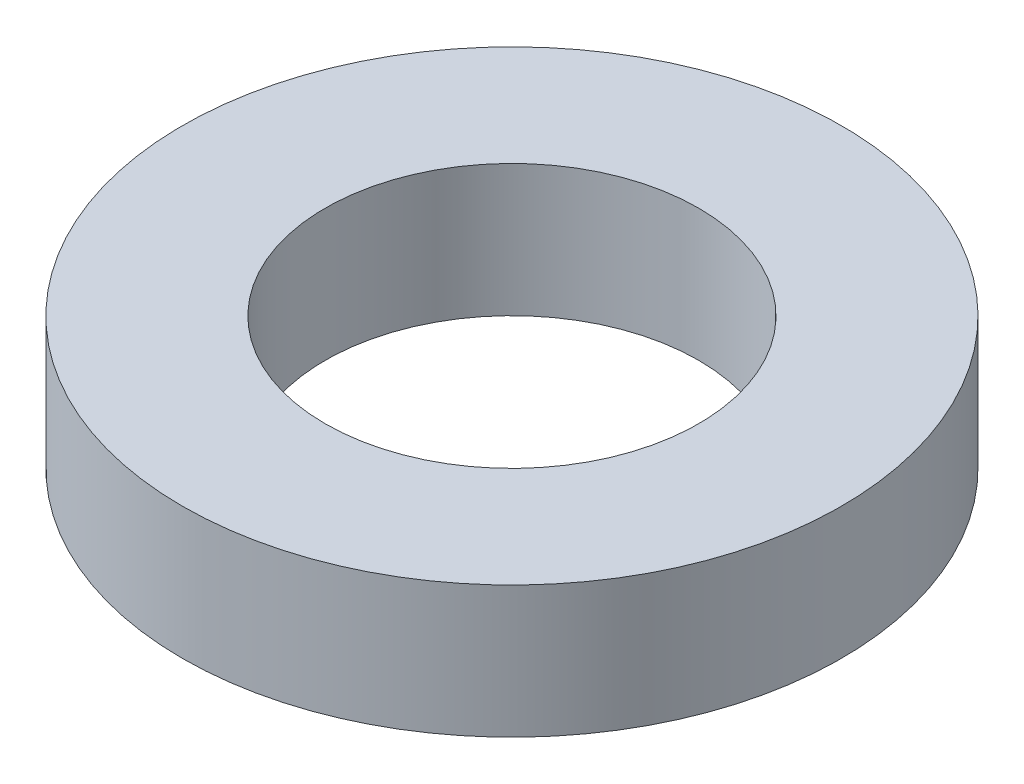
ISO-10303-21;
HEADER;
FILE_DESCRIPTION(('STEP AP214'),'2;1');
FILE_NAME('part.step','',(''),(''),'','','');
FILE_SCHEMA(('AUTOMOTIVE_DESIGN { 1 0 10303 214 1 1 1 1 }'));
ENDSEC;
DATA;
#1=APPLICATION_CONTEXT('core data for automotive mechanical design processes');
#2=APPLICATION_PROTOCOL_DEFINITION('international standard','automotive_design',2000,#1);
#3=PRODUCT_CONTEXT('',#1,'mechanical');
#4=PRODUCT('Part','Part','',(#3));
#5=PRODUCT_RELATED_PRODUCT_CATEGORY('part','',(#4));
#6=PRODUCT_DEFINITION_FORMATION('','',#4);
#7=PRODUCT_DEFINITION_CONTEXT('part definition',#1,'design');
#8=PRODUCT_DEFINITION('design','',#6,#7);
#9=PRODUCT_DEFINITION_SHAPE('','',#8);
#10=(LENGTH_UNIT() NAMED_UNIT(*) SI_UNIT(.MILLI.,.METRE.));
#11=(NAMED_UNIT(*) PLANE_ANGLE_UNIT() SI_UNIT($,.RADIAN.));
#12=(NAMED_UNIT(*) SI_UNIT($,.STERADIAN.) SOLID_ANGLE_UNIT());
#13=UNCERTAINTY_MEASURE_WITH_UNIT(LENGTH_MEASURE(1.E-05),#10,'distance_accuracy_value','');
#14=(GEOMETRIC_REPRESENTATION_CONTEXT(3) GLOBAL_UNCERTAINTY_ASSIGNED_CONTEXT((#13)) GLOBAL_UNIT_ASSIGNED_CONTEXT((#10,
#11,#12)) REPRESENTATION_CONTEXT('',''));
#15=CARTESIAN_POINT('',(0.,0.,0.));
#16=DIRECTION('',(0.,0.,1.));
#17=DIRECTION('',(1.,0.,0.));
#18=AXIS2_PLACEMENT_3D('',#15,#16,#17);
#19=CARTESIAN_POINT('',(0.,3.,0.));
#20=DIRECTION('',(0.,1.,0.));
#21=DIRECTION('',(0.,0.,1.));
#22=AXIS2_PLACEMENT_3D('',#19,#20,#21);
#23=PLANE('',#22);
#24=CARTESIAN_POINT('',(0.,3.,0.));
#25=DIRECTION('',(0.,1.,0.));
#26=DIRECTION('',(0.,0.,1.));
#27=AXIS2_PLACEMENT_3D('',#24,#25,#26);
#28=CIRCLE('',#27,7.5);
#29=CARTESIAN_POINT('',(0.,3.,7.5));
#30=VERTEX_POINT('',#29);
#31=EDGE_CURVE('E10',#30,#30,#28,.T.);
#32=ORIENTED_EDGE('',*,*,#31,.T.);
#33=EDGE_LOOP('',(#32));
#34=FACE_BOUND('',#33,.T.);
#35=CARTESIAN_POINT('',(0.,3.,0.));
#36=DIRECTION('',(0.,1.,0.));
#37=DIRECTION('',(0.,0.,1.));
#38=AXIS2_PLACEMENT_3D('',#35,#36,#37);
#39=CIRCLE('',#38,4.25);
#40=CARTESIAN_POINT('',(0.,3.,4.25));
#41=VERTEX_POINT('',#40);
#42=EDGE_CURVE('E57',#41,#41,#39,.T.);
#43=ORIENTED_EDGE('',*,*,#42,.F.);
#44=EDGE_LOOP('',(#43));
#45=FACE_BOUND('',#44,.T.);
#46=ADVANCED_FACE('F43',(#34,#45),#23,.T.);
#47=CARTESIAN_POINT('',(0.,0.,0.));
#48=DIRECTION('',(0.,1.,0.));
#49=DIRECTION('',(0.,0.,1.));
#50=AXIS2_PLACEMENT_3D('',#47,#48,#49);
#51=PLANE('',#50);
#52=CARTESIAN_POINT('',(0.,0.,0.));
#53=DIRECTION('',(0.,1.,0.));
#54=DIRECTION('',(0.,0.,1.));
#55=AXIS2_PLACEMENT_3D('',#52,#53,#54);
#56=CIRCLE('',#55,7.5);
#57=CARTESIAN_POINT('',(0.,0.,7.5));
#58=VERTEX_POINT('',#57);
#59=EDGE_CURVE('E50',#58,#58,#56,.T.);
#60=ORIENTED_EDGE('',*,*,#59,.F.);
#61=EDGE_LOOP('',(#60));
#62=FACE_BOUND('',#61,.T.);
#63=CARTESIAN_POINT('',(0.,0.,0.));
#64=DIRECTION('',(0.,1.,0.));
#65=DIRECTION('',(0.,0.,1.));
#66=AXIS2_PLACEMENT_3D('',#63,#64,#65);
#67=CIRCLE('',#66,4.25);
#68=CARTESIAN_POINT('',(0.,0.,4.25));
#69=VERTEX_POINT('',#68);
#70=EDGE_CURVE('E59',#69,#69,#67,.T.);
#71=ORIENTED_EDGE('',*,*,#70,.T.);
#72=EDGE_LOOP('',(#71));
#73=FACE_BOUND('',#72,.T.);
#74=ADVANCED_FACE('F68',(#62,#73),#51,.F.);
#75=CARTESIAN_POINT('',(0.,3.,0.));
#76=DIRECTION('',(0.,-1.,0.));
#77=DIRECTION('',(0.,0.,-1.));
#78=AXIS2_PLACEMENT_3D('',#75,#76,#77);
#79=CYLINDRICAL_SURFACE('',#78,7.5);
#80=ORIENTED_EDGE('',*,*,#31,.F.);
#81=EDGE_LOOP('',(#80));
#82=FACE_BOUND('',#81,.T.);
#83=ORIENTED_EDGE('',*,*,#59,.T.);
#84=EDGE_LOOP('',(#83));
#85=FACE_BOUND('',#84,.T.);
#86=ADVANCED_FACE('F44',(#82,#85),#79,.T.);
#87=CARTESIAN_POINT('',(0.,3.,0.));
#88=DIRECTION('',(0.,-1.,0.));
#89=DIRECTION('',(0.,0.,-1.));
#90=AXIS2_PLACEMENT_3D('',#87,#88,#89);
#91=CYLINDRICAL_SURFACE('',#90,4.25);
#92=ORIENTED_EDGE('',*,*,#42,.T.);
#93=EDGE_LOOP('',(#92));
#94=FACE_BOUND('',#93,.T.);
#95=ORIENTED_EDGE('',*,*,#70,.F.);
#96=EDGE_LOOP('',(#95));
#97=FACE_BOUND('',#96,.T.);
#98=ADVANCED_FACE('F67',(#94,#97),#91,.F.);
#99=CLOSED_SHELL('',(#46,#74,#86,#98));
#100=MANIFOLD_SOLID_BREP('B2',#99);
#101=ADVANCED_BREP_SHAPE_REPRESENTATION('',(#18,#100),#14);
#102=SHAPE_DEFINITION_REPRESENTATION(#9,#101);
ENDSEC;
END-ISO-10303-21;
